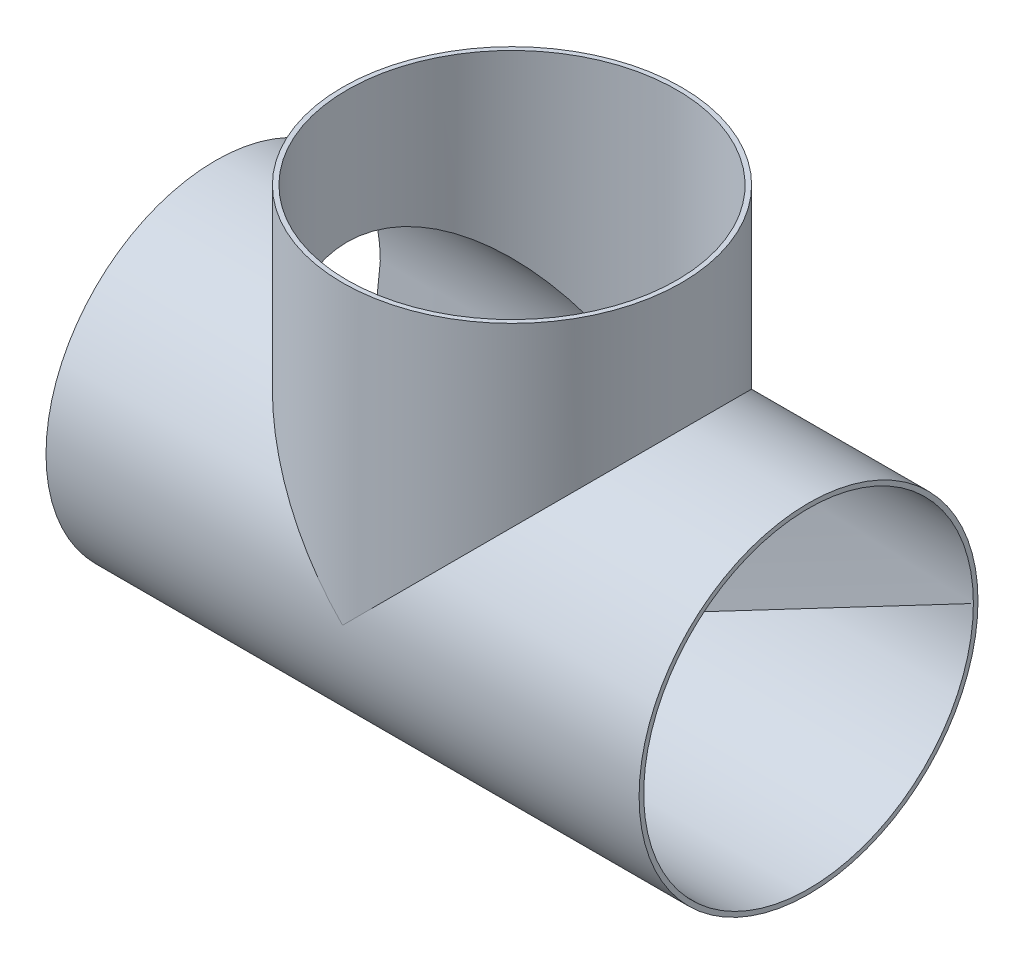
ISO-10303-21;
HEADER;
FILE_DESCRIPTION(('STEP AP214'),'2;1');
FILE_NAME('part.step','',(''),(''),'','','');
FILE_SCHEMA(('AUTOMOTIVE_DESIGN { 1 0 10303 214 1 1 1 1 }'));
ENDSEC;
DATA;
#1=APPLICATION_CONTEXT('core data for automotive mechanical design processes');
#2=APPLICATION_PROTOCOL_DEFINITION('international standard','automotive_design',2000,#1);
#3=PRODUCT_CONTEXT('',#1,'mechanical');
#4=PRODUCT('Part','Part','',(#3));
#5=PRODUCT_RELATED_PRODUCT_CATEGORY('part','',(#4));
#6=PRODUCT_DEFINITION_FORMATION('','',#4);
#7=PRODUCT_DEFINITION_CONTEXT('part definition',#1,'design');
#8=PRODUCT_DEFINITION('design','',#6,#7);
#9=PRODUCT_DEFINITION_SHAPE('','',#8);
#10=(LENGTH_UNIT() NAMED_UNIT(*) SI_UNIT(.MILLI.,.METRE.));
#11=(NAMED_UNIT(*) PLANE_ANGLE_UNIT() SI_UNIT($,.RADIAN.));
#12=(NAMED_UNIT(*) SI_UNIT($,.STERADIAN.) SOLID_ANGLE_UNIT());
#13=UNCERTAINTY_MEASURE_WITH_UNIT(LENGTH_MEASURE(1.E-05),#10,'distance_accuracy_value','');
#14=(GEOMETRIC_REPRESENTATION_CONTEXT(3) GLOBAL_UNCERTAINTY_ASSIGNED_CONTEXT((#13)) GLOBAL_UNIT_ASSIGNED_CONTEXT((#10,
#11,#12)) REPRESENTATION_CONTEXT('',''));
#15=CARTESIAN_POINT('',(0.,0.,0.));
#16=DIRECTION('',(0.,0.,1.));
#17=DIRECTION('',(1.,0.,0.));
#18=AXIS2_PLACEMENT_3D('',#15,#16,#17);
#19=CARTESIAN_POINT('',(0.,177.8,0.));
#20=DIRECTION('',(0.,1.,0.));
#21=DIRECTION('',(0.,0.,1.));
#22=AXIS2_PLACEMENT_3D('',#19,#20,#21);
#23=PLANE('',#22);
#24=CARTESIAN_POINT('',(0.,177.8,0.));
#25=DIRECTION('',(0.,1.,0.));
#26=DIRECTION('',(0.,0.,1.));
#27=AXIS2_PLACEMENT_3D('',#24,#25,#26);
#28=CIRCLE('',#27,101.6);
#29=CARTESIAN_POINT('',(0.,177.8,101.6));
#30=VERTEX_POINT('',#29);
#31=EDGE_CURVE('E68',#30,#30,#28,.T.);
#32=ORIENTED_EDGE('',*,*,#31,.T.);
#33=EDGE_LOOP('',(#32));
#34=FACE_BOUND('',#33,.T.);
#35=CARTESIAN_POINT('',(0.,177.8,0.));
#36=DIRECTION('',(0.,1.,0.));
#37=DIRECTION('',(0.,0.,1.));
#38=AXIS2_PLACEMENT_3D('',#35,#36,#37);
#39=CIRCLE('',#38,98.8314);
#40=CARTESIAN_POINT('',(0.,177.8,98.8314));
#41=VERTEX_POINT('',#40);
#42=EDGE_CURVE('E65',#41,#41,#39,.T.);
#43=ORIENTED_EDGE('',*,*,#42,.F.);
#44=EDGE_LOOP('',(#43));
#45=FACE_BOUND('',#44,.T.);
#46=ADVANCED_FACE('F33',(#34,#45),#23,.T.);
#47=CARTESIAN_POINT('',(177.8,0.,0.));
#48=DIRECTION('',(-1.,0.,0.));
#49=DIRECTION('',(0.,0.,1.));
#50=AXIS2_PLACEMENT_3D('',#47,#48,#49);
#51=CYLINDRICAL_SURFACE('',#50,101.6);
#52=CARTESIAN_POINT('',(-177.8,0.,0.));
#53=DIRECTION('',(1.,0.,0.));
#54=DIRECTION('',(0.,0.,-1.));
#55=AXIS2_PLACEMENT_3D('',#52,#53,#54);
#56=CIRCLE('',#55,101.6);
#57=CARTESIAN_POINT('',(-177.8,0.,-101.6));
#58=VERTEX_POINT('',#57);
#59=EDGE_CURVE('E74',#58,#58,#56,.T.);
#60=ORIENTED_EDGE('',*,*,#59,.T.);
#61=EDGE_LOOP('',(#60));
#62=FACE_BOUND('',#61,.T.);
#63=CARTESIAN_POINT('',(177.8,0.,0.));
#64=DIRECTION('',(1.,0.,0.));
#65=DIRECTION('',(0.,0.,-1.));
#66=AXIS2_PLACEMENT_3D('',#63,#64,#65);
#67=CIRCLE('',#66,101.6);
#68=CARTESIAN_POINT('',(177.8,0.,-101.6));
#69=VERTEX_POINT('',#68);
#70=EDGE_CURVE('E75',#69,#69,#67,.T.);
#71=ORIENTED_EDGE('',*,*,#70,.F.);
#72=EDGE_LOOP('',(#71));
#73=FACE_BOUND('',#72,.T.);
#74=CARTESIAN_POINT('',(0.,0.,0.));
#75=DIRECTION('',(-0.707106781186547,-0.707106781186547,0.));
#76=DIRECTION('',(-0.707106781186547,0.707106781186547,0.));
#77=AXIS2_PLACEMENT_3D('',#74,#75,#76);
#78=ELLIPSE('',#77,143.684097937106,101.6);
#79=CARTESIAN_POINT('',(0.,0.,-101.6));
#80=VERTEX_POINT('',#79);
#81=CARTESIAN_POINT('',(0.,0.,101.6));
#82=VERTEX_POINT('',#81);
#83=EDGE_CURVE('E11',#80,#82,#78,.F.);
#84=ORIENTED_EDGE('',*,*,#83,.F.);
#85=CARTESIAN_POINT('',(0.,0.,0.));
#86=DIRECTION('',(-0.707106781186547,0.707106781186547,0.));
#87=DIRECTION('',(-0.707106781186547,-0.707106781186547,0.));
#88=AXIS2_PLACEMENT_3D('',#85,#86,#87);
#89=ELLIPSE('',#88,143.684097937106,101.6);
#90=EDGE_CURVE('E41',#82,#80,#89,.T.);
#91=ORIENTED_EDGE('',*,*,#90,.F.);
#92=EDGE_LOOP('',(#84,#91));
#93=FACE_BOUND('',#92,.T.);
#94=ADVANCED_FACE('F35',(#62,#73,#93),#51,.T.);
#95=CARTESIAN_POINT('',(177.8,0.,0.));
#96=DIRECTION('',(1.,0.,0.));
#97=DIRECTION('',(0.,0.,-1.));
#98=AXIS2_PLACEMENT_3D('',#95,#96,#97);
#99=PLANE('',#98);
#100=CARTESIAN_POINT('',(177.8,0.,0.));
#101=DIRECTION('',(1.,0.,0.));
#102=DIRECTION('',(0.,0.,-1.));
#103=AXIS2_PLACEMENT_3D('',#100,#101,#102);
#104=CIRCLE('',#103,98.8314);
#105=CARTESIAN_POINT('',(177.8,0.,-98.8314));
#106=VERTEX_POINT('',#105);
#107=EDGE_CURVE('E149',#106,#106,#104,.T.);
#108=ORIENTED_EDGE('',*,*,#107,.F.);
#109=EDGE_LOOP('',(#108));
#110=FACE_BOUND('',#109,.T.);
#111=ORIENTED_EDGE('',*,*,#70,.T.);
#112=EDGE_LOOP('',(#111));
#113=FACE_BOUND('',#112,.T.);
#114=ADVANCED_FACE('F82',(#110,#113),#99,.T.);
#115=CARTESIAN_POINT('',(-177.8,0.,0.));
#116=DIRECTION('',(1.,0.,0.));
#117=DIRECTION('',(0.,0.,-1.));
#118=AXIS2_PLACEMENT_3D('',#115,#116,#117);
#119=PLANE('',#118);
#120=CARTESIAN_POINT('',(-177.8,0.,0.));
#121=DIRECTION('',(1.,0.,0.));
#122=DIRECTION('',(0.,0.,-1.));
#123=AXIS2_PLACEMENT_3D('',#120,#121,#122);
#124=CIRCLE('',#123,98.8314);
#125=CARTESIAN_POINT('',(-177.8,0.,-98.8314));
#126=VERTEX_POINT('',#125);
#127=EDGE_CURVE('E61',#126,#126,#124,.T.);
#128=ORIENTED_EDGE('',*,*,#127,.T.);
#129=EDGE_LOOP('',(#128));
#130=FACE_BOUND('',#129,.T.);
#131=ORIENTED_EDGE('',*,*,#59,.F.);
#132=EDGE_LOOP('',(#131));
#133=FACE_BOUND('',#132,.T.);
#134=ADVANCED_FACE('F88',(#130,#133),#119,.F.);
#135=CARTESIAN_POINT('',(0.,177.8,0.));
#136=DIRECTION('',(0.,-1.,0.));
#137=DIRECTION('',(0.,0.,-1.));
#138=AXIS2_PLACEMENT_3D('',#135,#136,#137);
#139=CYLINDRICAL_SURFACE('',#138,101.6);
#140=ORIENTED_EDGE('',*,*,#31,.F.);
#141=EDGE_LOOP('',(#140));
#142=FACE_BOUND('',#141,.T.);
#143=ORIENTED_EDGE('',*,*,#90,.T.);
#144=ORIENTED_EDGE('',*,*,#83,.T.);
#145=EDGE_LOOP('',(#143,#144));
#146=FACE_BOUND('',#145,.T.);
#147=ADVANCED_FACE('F80',(#142,#146),#139,.T.);
#148=CARTESIAN_POINT('',(0.,177.8,0.));
#149=DIRECTION('',(0.,-1.,0.));
#150=DIRECTION('',(0.,0.,-1.));
#151=AXIS2_PLACEMENT_3D('',#148,#149,#150);
#152=CYLINDRICAL_SURFACE('',#151,98.8314);
#153=CARTESIAN_POINT('',(0.,0.,0.));
#154=DIRECTION('',(0.707106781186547,-0.707106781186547,0.));
#155=DIRECTION('',(-0.707106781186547,-0.707106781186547,0.));
#156=AXIS2_PLACEMENT_3D('',#153,#154,#155);
#157=ELLIPSE('',#156,139.76870626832,98.8314);
#158=CARTESIAN_POINT('',(0.,0.,98.8314));
#159=VERTEX_POINT('',#158);
#160=CARTESIAN_POINT('',(0.,0.,-98.8314));
#161=VERTEX_POINT('',#160);
#162=EDGE_CURVE('E47',#159,#161,#157,.F.);
#163=ORIENTED_EDGE('',*,*,#162,.F.);
#164=CARTESIAN_POINT('',(0.,0.,0.));
#165=DIRECTION('',(-0.707106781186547,-0.707106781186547,0.));
#166=DIRECTION('',(0.707106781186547,-0.707106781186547,0.));
#167=AXIS2_PLACEMENT_3D('',#164,#165,#166);
#168=ELLIPSE('',#167,139.76870626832,98.8314);
#169=EDGE_CURVE('E57',#161,#159,#168,.F.);
#170=ORIENTED_EDGE('',*,*,#169,.F.);
#171=EDGE_LOOP('',(#163,#170));
#172=FACE_BOUND('',#171,.T.);
#173=ORIENTED_EDGE('',*,*,#42,.T.);
#174=EDGE_LOOP('',(#173));
#175=FACE_BOUND('',#174,.T.);
#176=ADVANCED_FACE('F63',(#172,#175),#152,.F.);
#177=CARTESIAN_POINT('',(-177.8,0.,0.));
#178=DIRECTION('',(1.,0.,0.));
#179=DIRECTION('',(0.,0.,-1.));
#180=AXIS2_PLACEMENT_3D('',#177,#178,#179);
#181=CYLINDRICAL_SURFACE('',#180,98.8314);
#182=ORIENTED_EDGE('',*,*,#162,.T.);
#183=ORIENTED_EDGE('',*,*,#169,.T.);
#184=EDGE_LOOP('',(#182,#183));
#185=FACE_BOUND('',#184,.T.);
#186=ORIENTED_EDGE('',*,*,#127,.F.);
#187=EDGE_LOOP('',(#186));
#188=FACE_BOUND('',#187,.T.);
#189=ORIENTED_EDGE('',*,*,#107,.T.);
#190=EDGE_LOOP('',(#189));
#191=FACE_BOUND('',#190,.T.);
#192=ADVANCED_FACE('F58',(#185,#188,#191),#181,.F.);
#193=CLOSED_SHELL('',(#46,#94,#114,#134,#147,#176,#192));
#194=MANIFOLD_SOLID_BREP('B2',#193);
#195=ADVANCED_BREP_SHAPE_REPRESENTATION('',(#18,#194),#14);
#196=SHAPE_DEFINITION_REPRESENTATION(#9,#195);
ENDSEC;
END-ISO-10303-21;
